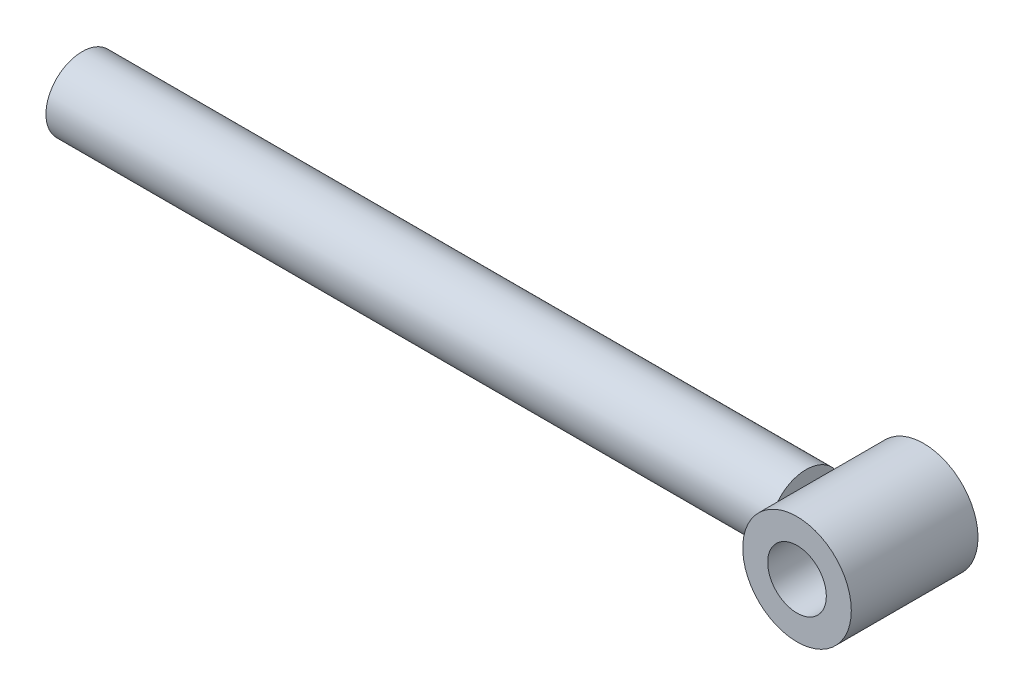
ISO-10303-21;
HEADER;
FILE_DESCRIPTION(('STEP AP214'),'2;1');
FILE_NAME('part.step','',(''),(''),'','','');
FILE_SCHEMA(('AUTOMOTIVE_DESIGN { 1 0 10303 214 1 1 1 1 }'));
ENDSEC;
DATA;
#1=APPLICATION_CONTEXT('core data for automotive mechanical design processes');
#2=APPLICATION_PROTOCOL_DEFINITION('international standard','automotive_design',2000,#1);
#3=PRODUCT_CONTEXT('',#1,'mechanical');
#4=PRODUCT('Part','Part','',(#3));
#5=PRODUCT_RELATED_PRODUCT_CATEGORY('part','',(#4));
#6=PRODUCT_DEFINITION_FORMATION('','',#4);
#7=PRODUCT_DEFINITION_CONTEXT('part definition',#1,'design');
#8=PRODUCT_DEFINITION('design','',#6,#7);
#9=PRODUCT_DEFINITION_SHAPE('','',#8);
#10=(LENGTH_UNIT() NAMED_UNIT(*) SI_UNIT(.MILLI.,.METRE.));
#11=(NAMED_UNIT(*) PLANE_ANGLE_UNIT() SI_UNIT($,.RADIAN.));
#12=(NAMED_UNIT(*) SI_UNIT($,.STERADIAN.) SOLID_ANGLE_UNIT());
#13=UNCERTAINTY_MEASURE_WITH_UNIT(LENGTH_MEASURE(1.E-05),#10,'distance_accuracy_value','');
#14=(GEOMETRIC_REPRESENTATION_CONTEXT(3) GLOBAL_UNCERTAINTY_ASSIGNED_CONTEXT((#13)) GLOBAL_UNIT_ASSIGNED_CONTEXT((#10,
#11,#12)) REPRESENTATION_CONTEXT('',''));
#15=CARTESIAN_POINT('',(0.,0.,0.));
#16=DIRECTION('',(0.,0.,1.));
#17=DIRECTION('',(1.,0.,0.));
#18=AXIS2_PLACEMENT_3D('',#15,#16,#17);
#19=CARTESIAN_POINT('',(215.,0.,17.5));
#20=DIRECTION('',(0.,0.,1.));
#21=DIRECTION('',(1.,0.,0.));
#22=AXIS2_PLACEMENT_3D('',#19,#20,#21);
#23=PLANE('',#22);
#24=CARTESIAN_POINT('',(215.,0.,17.5));
#25=DIRECTION('',(0.,0.,1.));
#26=DIRECTION('',(1.,0.,0.));
#27=AXIS2_PLACEMENT_3D('',#24,#25,#26);
#28=CIRCLE('',#27,15.);
#29=CARTESIAN_POINT('',(230.,0.,17.5));
#30=VERTEX_POINT('',#29);
#31=EDGE_CURVE('E11',#30,#30,#28,.T.);
#32=ORIENTED_EDGE('',*,*,#31,.T.);
#33=EDGE_LOOP('',(#32));
#34=FACE_BOUND('',#33,.T.);
#35=CARTESIAN_POINT('',(215.,0.,17.5));
#36=DIRECTION('',(0.,0.,1.));
#37=DIRECTION('',(1.,0.,0.));
#38=AXIS2_PLACEMENT_3D('',#35,#36,#37);
#39=CIRCLE('',#38,8.1);
#40=CARTESIAN_POINT('',(223.1,0.,17.5));
#41=VERTEX_POINT('',#40);
#42=EDGE_CURVE('E47',#41,#41,#39,.T.);
#43=ORIENTED_EDGE('',*,*,#42,.F.);
#44=EDGE_LOOP('',(#43));
#45=FACE_BOUND('',#44,.T.);
#46=ADVANCED_FACE('F36',(#34,#45),#23,.T.);
#47=CARTESIAN_POINT('',(215.,0.,-17.5));
#48=DIRECTION('',(0.,0.,1.));
#49=DIRECTION('',(1.,0.,0.));
#50=AXIS2_PLACEMENT_3D('',#47,#48,#49);
#51=PLANE('',#50);
#52=CARTESIAN_POINT('',(215.,0.,-17.5));
#53=DIRECTION('',(0.,0.,1.));
#54=DIRECTION('',(1.,0.,0.));
#55=AXIS2_PLACEMENT_3D('',#52,#53,#54);
#56=CIRCLE('',#55,15.);
#57=CARTESIAN_POINT('',(230.,0.,-17.5));
#58=VERTEX_POINT('',#57);
#59=EDGE_CURVE('E43',#58,#58,#56,.T.);
#60=ORIENTED_EDGE('',*,*,#59,.F.);
#61=EDGE_LOOP('',(#60));
#62=FACE_BOUND('',#61,.T.);
#63=CARTESIAN_POINT('',(215.,0.,-17.5));
#64=DIRECTION('',(0.,0.,1.));
#65=DIRECTION('',(1.,0.,0.));
#66=AXIS2_PLACEMENT_3D('',#63,#64,#65);
#67=CIRCLE('',#66,8.1);
#68=CARTESIAN_POINT('',(223.1,0.,-17.5));
#69=VERTEX_POINT('',#68);
#70=EDGE_CURVE('E51',#69,#69,#67,.T.);
#71=ORIENTED_EDGE('',*,*,#70,.T.);
#72=EDGE_LOOP('',(#71));
#73=FACE_BOUND('',#72,.T.);
#74=ADVANCED_FACE('F57',(#62,#73),#51,.F.);
#75=CARTESIAN_POINT('',(215.,0.,17.5));
#76=DIRECTION('',(0.,0.,-1.));
#77=DIRECTION('',(-1.,0.,0.));
#78=AXIS2_PLACEMENT_3D('',#75,#76,#77);
#79=CYLINDRICAL_SURFACE('',#78,15.);
#80=ORIENTED_EDGE('',*,*,#31,.F.);
#81=EDGE_LOOP('',(#80));
#82=FACE_BOUND('',#81,.T.);
#83=ORIENTED_EDGE('',*,*,#59,.T.);
#84=EDGE_LOOP('',(#83));
#85=FACE_BOUND('',#84,.T.);
#86=ADVANCED_FACE('F38',(#82,#85),#79,.T.);
#87=CARTESIAN_POINT('',(215.,0.,17.5));
#88=DIRECTION('',(0.,0.,-1.));
#89=DIRECTION('',(-1.,0.,0.));
#90=AXIS2_PLACEMENT_3D('',#87,#88,#89);
#91=CYLINDRICAL_SURFACE('',#90,8.1);
#92=ORIENTED_EDGE('',*,*,#42,.T.);
#93=EDGE_LOOP('',(#92));
#94=FACE_BOUND('',#93,.T.);
#95=ORIENTED_EDGE('',*,*,#70,.F.);
#96=EDGE_LOOP('',(#95));
#97=FACE_BOUND('',#96,.T.);
#98=ADVANCED_FACE('F59',(#94,#97),#91,.F.);
#99=CLOSED_SHELL('',(#46,#74,#86,#98));
#100=MANIFOLD_SOLID_BREP('B2',#99);
#101=CARTESIAN_POINT('',(200.,0.,0.));
#102=DIRECTION('',(-1.,0.,0.));
#103=DIRECTION('',(0.,0.,1.));
#104=AXIS2_PLACEMENT_3D('',#101,#102,#103);
#105=CYLINDRICAL_SURFACE('',#104,10.);
#106=CARTESIAN_POINT('',(200.,0.,0.));
#107=DIRECTION('',(1.,0.,0.));
#108=DIRECTION('',(0.,0.,-1.));
#109=AXIS2_PLACEMENT_3D('',#106,#107,#108);
#110=CIRCLE('',#109,10.);
#111=CARTESIAN_POINT('',(200.,0.,-10.));
#112=VERTEX_POINT('',#111);
#113=EDGE_CURVE('E35',#112,#112,#110,.T.);
#114=ORIENTED_EDGE('',*,*,#113,.F.);
#115=EDGE_LOOP('',(#114));
#116=FACE_BOUND('',#115,.T.);
#117=CARTESIAN_POINT('',(0.,0.,0.));
#118=DIRECTION('',(1.,0.,0.));
#119=DIRECTION('',(0.,0.,-1.));
#120=AXIS2_PLACEMENT_3D('',#117,#118,#119);
#121=CIRCLE('',#120,10.);
#122=CARTESIAN_POINT('',(0.,0.,-10.));
#123=VERTEX_POINT('',#122);
#124=EDGE_CURVE('E103',#123,#123,#121,.T.);
#125=ORIENTED_EDGE('',*,*,#124,.T.);
#126=EDGE_LOOP('',(#125));
#127=FACE_BOUND('',#126,.T.);
#128=ADVANCED_FACE('F97',(#116,#127),#105,.T.);
#129=CARTESIAN_POINT('',(200.,0.,0.));
#130=DIRECTION('',(1.,0.,0.));
#131=DIRECTION('',(0.,0.,-1.));
#132=AXIS2_PLACEMENT_3D('',#129,#130,#131);
#133=PLANE('',#132);
#134=ORIENTED_EDGE('',*,*,#113,.T.);
#135=EDGE_LOOP('',(#134));
#136=FACE_BOUND('',#135,.T.);
#137=ADVANCED_FACE('F112',(#136),#133,.T.);
#138=CARTESIAN_POINT('',(0.,0.,0.));
#139=DIRECTION('',(1.,0.,0.));
#140=DIRECTION('',(0.,0.,-1.));
#141=AXIS2_PLACEMENT_3D('',#138,#139,#140);
#142=PLANE('',#141);
#143=ORIENTED_EDGE('',*,*,#124,.F.);
#144=EDGE_LOOP('',(#143));
#145=FACE_BOUND('',#144,.T.);
#146=ADVANCED_FACE('F110',(#145),#142,.F.);
#147=CLOSED_SHELL('',(#128,#137,#146));
#148=MANIFOLD_SOLID_BREP('B6',#147);
#149=ADVANCED_BREP_SHAPE_REPRESENTATION('',(#18,#100,#148),#14);
#150=SHAPE_DEFINITION_REPRESENTATION(#9,#149);
ENDSEC;
END-ISO-10303-21;
